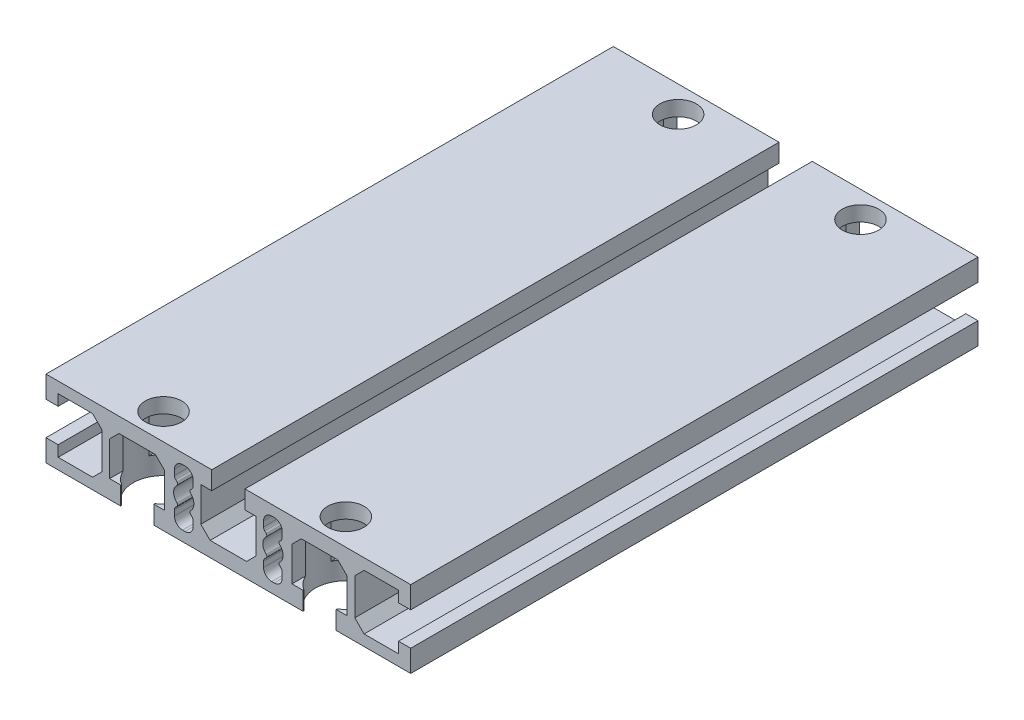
from build123d import *

# Parameters (mm, degrees)
BOSS_EXTRUDE1_DEPTH                     = 70
BOSS_EXTRUDE1_DEPTH_BACK                = 70
CBORE_FOR_M8_HEX_HEAD_BOLT1_D           = 9
CBORE_FOR_M8_HEX_HEAD_BOLT1_CBORE_D     = 15
CBORE_FOR_M8_HEX_HEAD_BOLT1_CBORE_DEPTH = 15.3


with BuildPart() as part:
    # Sketch1 → Boss-Extrude1 (new, two sides: drawn at the far end of the back side and taken through both)
    with BuildSketch(Plane.XY.offset(-BOSS_EXTRUDE1_DEPTH_BACK)):
        Polygon((-15.7, 3.5), (-15.7, -5), (-18.4, -5), (-18.4, -9.5), (18.4, -9.5), (18.4, -5), (15.7, -5), (15.7, 3.5), (18, 5.8), (27, 5.8), (29.3, 3.5), (29.3, -5), (26.6, -5), (26.6, -9.5), (45, -9.5), (45, -4.1), (42, -4.1), (42, -6.8), (33.5, -6.8), (31.2, -4.5), (31.2, 4.5), (33.5, 6.8), (42, 6.8), (42, 4.1), (45, 4.1), (45, 9.5), (4.1, 9.5), (4.1, 5), (6.8, 5), (6.8, -3.5), (4.5, -5.8), (-4.5, -5.8), (-6.8, -3.5), (-6.8, 5), (-4.1, 5), (-4.1, 9.5), (-45, 9.5), (-45, 4.1), (-42, 4.1), (-42, 6.8), (-33.5, 6.8), (-31.2, 4.5), (-31.2, -4.5), (-33.5, -6.8), (-42, -6.8), (-42, -4.1), (-45, -4.1), (-45, -9.5), (-26.6, -9.5), (-26.6, -5), (-29.3, -5), (-29.3, 3.5), (-27, 5.8), (-18, 5.8), align=None)
        with BuildLine():
            Line((-13.299970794, -4.999975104), (-13.299970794, -3.657373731))
            ThreePointArc((-13.299970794, -3.657373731), (-13.223850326, -3.274690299), (-13.007077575, -2.95026695))
            Line((-13.007077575, -2.95026695), (-12.646417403, -2.589606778))
            ThreePointArc((-12.646417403, -2.589606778), (-12.500164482, -2.222137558), (-12.66663746, -1.863375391))
            ThreePointArc((-12.66663746, -1.863375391), (-13.499970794, 1.459e-05), (-12.66663746, 1.863404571))
            ThreePointArc((-12.66663746, 1.863404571), (-12.500164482, 2.222166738), (-12.646417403, 2.589635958))
            Line((-12.646417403, 2.589635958), (-13.007077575, 2.95029613))
            ThreePointArc((-13.007077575, 2.95029613), (-13.223850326, 3.274719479), (-13.299970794, 3.657402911))
            Line((-13.299970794, 3.657402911), (-13.299970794, 5.000004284))
            ThreePointArc((-13.299970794, 5.000004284), (-12.714184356, 6.414217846), (-11.299970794, 7.000004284))
            Line((-11.299970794, 7.000004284), (-10.699970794, 7.000004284))
            ThreePointArc((-10.699970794, 7.000004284), (-9.285757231, 6.414217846), (-8.699970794, 5.000004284))
            Line((-8.699970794, 5.000004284), (-8.699970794, 3.657402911))
            ThreePointArc((-8.699970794, 3.657402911), (-8.776091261, 3.274719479), (-8.992864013, 2.95029613))
            Line((-8.992864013, 2.95029613), (-9.353524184, 2.589635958))
            ThreePointArc((-9.353524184, 2.589635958), (-9.499777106, 2.222166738), (-9.333304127, 1.863404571))
            ThreePointArc((-9.333304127, 1.863404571), (-8.499970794, 1.459e-05), (-9.333304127, -1.863375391))
            ThreePointArc((-9.333304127, -1.863375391), (-9.499777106, -2.222137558), (-9.353524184, -2.589606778))
            Line((-9.353524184, -2.589606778), (-8.992864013, -2.95026695))
            ThreePointArc((-8.992864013, -2.95026695), (-8.776091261, -3.274690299), (-8.699970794, -3.657373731))
            Line((-8.699970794, -3.657373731), (-8.699970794, -4.999975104))
            ThreePointArc((-8.699970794, -4.999975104), (-9.285757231, -6.414188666), (-10.699970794, -6.999975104))
            Line((-10.699970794, -6.999975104), (-11.299970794, -6.999975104))
            ThreePointArc((-11.299970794, -6.999975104), (-12.714184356, -6.414188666), (-13.299970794, -4.999975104))
        make_face(mode=Mode.SUBTRACT)
        with BuildLine():
            Line((13.007077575, 2.95029613), (12.646417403, 2.589635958))
            ThreePointArc((12.646417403, 2.589635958), (12.500164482, 2.222166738), (12.66663746, 1.863404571))
            ThreePointArc((12.66663746, 1.863404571), (13.499970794, 1.459e-05), (12.66663746, -1.863375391))
            ThreePointArc((12.66663746, -1.863375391), (12.500164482, -2.222137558), (12.646417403, -2.589606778))
            Line((12.646417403, -2.589606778), (13.007077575, -2.95026695))
            ThreePointArc((13.007077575, -2.95026695), (13.223850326, -3.274690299), (13.299970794, -3.657373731))
            Line((13.299970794, -3.657373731), (13.299970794, -4.999975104))
            ThreePointArc((13.299970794, -4.999975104), (12.714184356, -6.414188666), (11.299970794, -6.999975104))
            Line((11.299970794, -6.999975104), (10.699970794, -6.999975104))
            ThreePointArc((10.699970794, -6.999975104), (9.285757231, -6.414188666), (8.699970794, -4.999975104))
            Line((8.699970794, -4.999975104), (8.699970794, -3.657373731))
            ThreePointArc((8.699970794, -3.657373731), (8.776091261, -3.274690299), (8.992864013, -2.95026695))
            Line((8.992864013, -2.95026695), (9.353524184, -2.589606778))
            ThreePointArc((9.353524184, -2.589606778), (9.499777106, -2.222137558), (9.333304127, -1.863375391))
            ThreePointArc((9.333304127, -1.863375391), (8.499970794, 1.459e-05), (9.333304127, 1.863404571))
            ThreePointArc((9.333304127, 1.863404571), (9.499777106, 2.222166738), (9.353524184, 2.589635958))
            Line((9.353524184, 2.589635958), (8.992864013, 2.95029613))
            ThreePointArc((8.992864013, 2.95029613), (8.776091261, 3.274719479), (8.699970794, 3.657402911))
            Line((8.699970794, 3.657402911), (8.699970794, 5.000004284))
            ThreePointArc((8.699970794, 5.000004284), (9.285757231, 6.414217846), (10.699970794, 7.000004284))
            Line((10.699970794, 7.000004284), (11.299970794, 7.000004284))
            ThreePointArc((11.299970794, 7.000004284), (12.714184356, 6.414217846), (13.299970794, 5.000004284))
            Line((13.299970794, 5.000004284), (13.299970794, 3.657402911))
            ThreePointArc((13.299970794, 3.657402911), (13.223850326, 3.274719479), (13.007077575, 2.95029613))
        make_face(mode=Mode.SUBTRACT)
    extrude(amount=BOSS_EXTRUDE1_DEPTH + BOSS_EXTRUDE1_DEPTH_BACK)

    # CBORE for M8 Hex Head Bolt1 (through all)
    with Locations(Plane.XZ.offset(9.5)):
        with Locations((-22.5, 63.5), (-22.5, -63.5), (22.5, -63.5), (22.5, 63.5)):
            CounterBoreHole(CBORE_FOR_M8_HEX_HEAD_BOLT1_D / 2, CBORE_FOR_M8_HEX_HEAD_BOLT1_CBORE_D / 2, CBORE_FOR_M8_HEX_HEAD_BOLT1_CBORE_DEPTH)


solid = part.part
